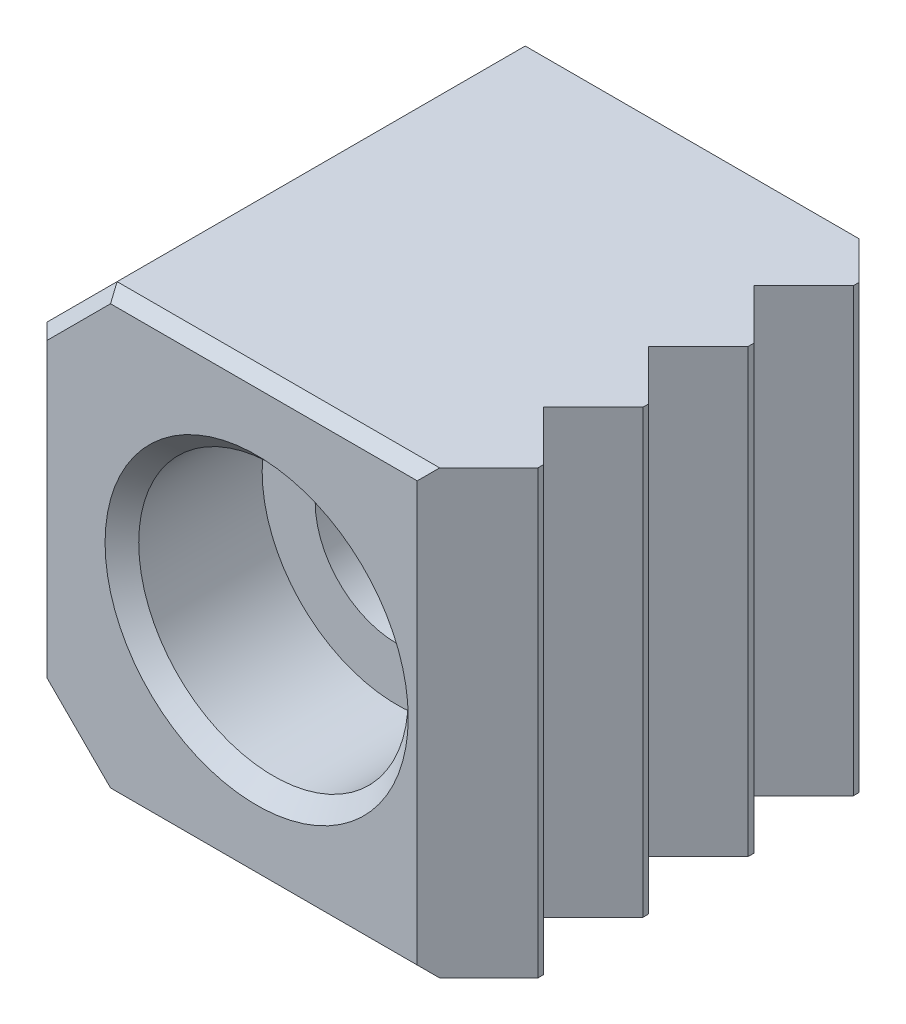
ISO-10303-21;
HEADER;
FILE_DESCRIPTION(('STEP AP214'),'2;1');
FILE_NAME('part.step','',(''),(''),'','','');
FILE_SCHEMA(('AUTOMOTIVE_DESIGN { 1 0 10303 214 1 1 1 1 }'));
ENDSEC;
DATA;
#1=APPLICATION_CONTEXT('core data for automotive mechanical design processes');
#2=APPLICATION_PROTOCOL_DEFINITION('international standard','automotive_design',2000,#1);
#3=PRODUCT_CONTEXT('',#1,'mechanical');
#4=PRODUCT('Part','Part','',(#3));
#5=PRODUCT_RELATED_PRODUCT_CATEGORY('part','',(#4));
#6=PRODUCT_DEFINITION_FORMATION('','',#4);
#7=PRODUCT_DEFINITION_CONTEXT('part definition',#1,'design');
#8=PRODUCT_DEFINITION('design','',#6,#7);
#9=PRODUCT_DEFINITION_SHAPE('','',#8);
#10=(LENGTH_UNIT() NAMED_UNIT(*) SI_UNIT(.MILLI.,.METRE.));
#11=(NAMED_UNIT(*) PLANE_ANGLE_UNIT() SI_UNIT($,.RADIAN.));
#12=(NAMED_UNIT(*) SI_UNIT($,.STERADIAN.) SOLID_ANGLE_UNIT());
#13=UNCERTAINTY_MEASURE_WITH_UNIT(LENGTH_MEASURE(1.E-05),#10,'distance_accuracy_value','');
#14=(GEOMETRIC_REPRESENTATION_CONTEXT(3) GLOBAL_UNCERTAINTY_ASSIGNED_CONTEXT((#13)) GLOBAL_UNIT_ASSIGNED_CONTEXT((#10,
#11,#12)) REPRESENTATION_CONTEXT('',''));
#15=CARTESIAN_POINT('',(0.,0.,0.));
#16=DIRECTION('',(0.,0.,1.));
#17=DIRECTION('',(1.,0.,0.));
#18=AXIS2_PLACEMENT_3D('',#15,#16,#17);
#19=CARTESIAN_POINT('',(5.,-5.,10.));
#20=DIRECTION('',(-1.,0.,0.));
#21=DIRECTION('',(0.,-1.,0.));
#22=AXIS2_PLACEMENT_3D('',#19,#20,#21);
#23=PLANE('',#22);
#24=DIRECTION('',(0.,-1.,0.));
#25=VECTOR('',#24,1.);
#26=CARTESIAN_POINT('',(5.,-5.,6.127125));
#27=LINE('',#26,#25);
#28=CARTESIAN_POINT('',(5.,5.,6.127125));
#29=VERTEX_POINT('',#28);
#30=CARTESIAN_POINT('',(5.,-5.,6.127125));
#31=VERTEX_POINT('',#30);
#32=EDGE_CURVE('E238',#29,#31,#27,.T.);
#33=ORIENTED_EDGE('',*,*,#32,.F.);
#34=DIRECTION('',(0.,0.,-1.));
#35=VECTOR('',#34,1.);
#36=CARTESIAN_POINT('',(5.,5.,10.));
#37=LINE('',#36,#35);
#38=CARTESIAN_POINT('',(5.,5.,6.25412500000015));
#39=VERTEX_POINT('',#38);
#40=EDGE_CURVE('E440',#39,#29,#37,.T.);
#41=ORIENTED_EDGE('',*,*,#40,.F.);
#42=DIRECTION('',(0.,1.,0.));
#43=VECTOR('',#42,1.);
#44=CARTESIAN_POINT('',(5.,-5.,6.25412500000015));
#45=LINE('',#44,#43);
#46=CARTESIAN_POINT('',(5.,-5.,6.25412500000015));
#47=VERTEX_POINT('',#46);
#48=EDGE_CURVE('E236',#47,#39,#45,.T.);
#49=ORIENTED_EDGE('',*,*,#48,.F.);
#50=DIRECTION('',(0.,0.,-1.));
#51=VECTOR('',#50,1.);
#52=CARTESIAN_POINT('',(5.,-5.,10.));
#53=LINE('',#52,#51);
#54=EDGE_CURVE('E197',#47,#31,#53,.T.);
#55=ORIENTED_EDGE('',*,*,#54,.T.);
#56=EDGE_LOOP('',(#33,#41,#49,#55));
#57=FACE_BOUND('',#56,.T.);
#58=ADVANCED_FACE('F15',(#57),#23,.F.);
#59=CARTESIAN_POINT('',(5.,-5.,3.87287499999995));
#60=VERTEX_POINT('',#59);
#61=CARTESIAN_POINT('',(5.,-5.,3.74587499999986));
#62=VERTEX_POINT('',#61);
#63=EDGE_CURVE('E255',#60,#62,#53,.T.);
#64=ORIENTED_EDGE('',*,*,#63,.T.);
#65=DIRECTION('',(0.,1.,0.));
#66=VECTOR('',#65,1.);
#67=CARTESIAN_POINT('',(5.,-5.,3.74587499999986));
#68=LINE('',#67,#66);
#69=CARTESIAN_POINT('',(5.,5.,3.74587499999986));
#70=VERTEX_POINT('',#69);
#71=EDGE_CURVE('E243',#62,#70,#68,.T.);
#72=ORIENTED_EDGE('',*,*,#71,.T.);
#73=CARTESIAN_POINT('',(5.,5.,3.87287499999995));
#74=VERTEX_POINT('',#73);
#75=EDGE_CURVE('E260',#74,#70,#37,.T.);
#76=ORIENTED_EDGE('',*,*,#75,.F.);
#77=DIRECTION('',(0.,-1.,0.));
#78=VECTOR('',#77,1.);
#79=CARTESIAN_POINT('',(5.,-5.,3.87287499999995));
#80=LINE('',#79,#78);
#81=EDGE_CURVE('E240',#74,#60,#80,.T.);
#82=ORIENTED_EDGE('',*,*,#81,.T.);
#83=EDGE_LOOP('',(#64,#72,#76,#82));
#84=FACE_BOUND('',#83,.T.);
#85=ADVANCED_FACE('F413',(#84),#23,.F.);
#86=DIRECTION('',(0.,-1.,0.));
#87=VECTOR('',#86,1.);
#88=CARTESIAN_POINT('',(5.,-5.,8.50837500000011));
#89=LINE('',#88,#87);
#90=CARTESIAN_POINT('',(5.,5.,8.50837500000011));
#91=VERTEX_POINT('',#90);
#92=CARTESIAN_POINT('',(5.,-5.,8.50837500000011));
#93=VERTEX_POINT('',#92);
#94=EDGE_CURVE('E186',#91,#93,#89,.T.);
#95=ORIENTED_EDGE('',*,*,#94,.F.);
#96=CARTESIAN_POINT('',(5.,5.,8.635375));
#97=VERTEX_POINT('',#96);
#98=EDGE_CURVE('E261',#97,#91,#37,.T.);
#99=ORIENTED_EDGE('',*,*,#98,.F.);
#100=DIRECTION('',(0.,1.,0.));
#101=VECTOR('',#100,1.);
#102=CARTESIAN_POINT('',(5.,-5.,8.6353750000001));
#103=LINE('',#102,#101);
#104=CARTESIAN_POINT('',(5.,-5.,8.6353750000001));
#105=VERTEX_POINT('',#104);
#106=EDGE_CURVE('E230',#105,#97,#103,.T.);
#107=ORIENTED_EDGE('',*,*,#106,.F.);
#108=EDGE_CURVE('E256',#105,#93,#53,.T.);
#109=ORIENTED_EDGE('',*,*,#108,.T.);
#110=EDGE_LOOP('',(#95,#99,#107,#109));
#111=FACE_BOUND('',#110,.T.);
#112=ADVANCED_FACE('F418',(#111),#23,.F.);
#113=CARTESIAN_POINT('',(-5.,5.,10.));
#114=DIRECTION('',(0.,1.,0.));
#115=DIRECTION('',(-1.,0.,0.));
#116=AXIS2_PLACEMENT_3D('',#113,#114,#115);
#117=PLANE('',#116);
#118=DIRECTION('',(0.,0.,1.));
#119=VECTOR('',#118,1.);
#120=CARTESIAN_POINT('',(-3.4125,5.,10.));
#121=LINE('',#120,#119);
#122=CARTESIAN_POINT('',(-3.4125,5.,0.508));
#123=VERTEX_POINT('',#122);
#124=CARTESIAN_POINT('',(-3.4125,5.,9.746));
#125=VERTEX_POINT('',#124);
#126=EDGE_CURVE('E274',#123,#125,#121,.T.);
#127=ORIENTED_EDGE('',*,*,#126,.T.);
#128=DIRECTION('',(1.,0.,0.));
#129=VECTOR('',#128,1.);
#130=CARTESIAN_POINT('',(3.635375,5.,9.746));
#131=LINE('',#130,#129);
#132=CARTESIAN_POINT('',(3.889375,5.,9.746));
#133=VERTEX_POINT('',#132);
#134=EDGE_CURVE('E9',#125,#133,#131,.T.);
#135=ORIENTED_EDGE('',*,*,#134,.T.);
#136=DIRECTION('',(-0.70710678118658,0.,0.707106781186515));
#137=VECTOR('',#136,1.);
#138=CARTESIAN_POINT('',(5.0635,5.,8.57187500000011));
#139=LINE('',#138,#137);
#140=EDGE_CURVE('E214',#97,#133,#139,.T.);
#141=ORIENTED_EDGE('',*,*,#140,.F.);
#142=ORIENTED_EDGE('',*,*,#98,.T.);
#143=DIRECTION('',(0.707106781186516,0.,0.707106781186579));
#144=VECTOR('',#143,1.);
#145=CARTESIAN_POINT('',(3.872875,5.,7.38125));
#146=LINE('',#145,#144);
#147=CARTESIAN_POINT('',(3.872875,5.,7.38125));
#148=VERTEX_POINT('',#147);
#149=EDGE_CURVE('E217',#148,#91,#146,.T.);
#150=ORIENTED_EDGE('',*,*,#149,.F.);
#151=DIRECTION('',(-0.707106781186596,0.,0.707106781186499));
#152=VECTOR('',#151,1.);
#153=CARTESIAN_POINT('',(5.0635,5.,6.19062500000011));
#154=LINE('',#153,#152);
#155=EDGE_CURVE('E176',#39,#148,#154,.T.);
#156=ORIENTED_EDGE('',*,*,#155,.F.);
#157=ORIENTED_EDGE('',*,*,#40,.T.);
#158=DIRECTION('',(0.707106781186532,0.,0.707106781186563));
#159=VECTOR('',#158,1.);
#160=CARTESIAN_POINT('',(3.872875,5.,5.));
#161=LINE('',#160,#159);
#162=CARTESIAN_POINT('',(3.872875,5.,5.));
#163=VERTEX_POINT('',#162);
#164=EDGE_CURVE('E220',#163,#29,#161,.T.);
#165=ORIENTED_EDGE('',*,*,#164,.F.);
#166=DIRECTION('',(0.707106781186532,0.,-0.707106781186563));
#167=VECTOR('',#166,1.);
#168=CARTESIAN_POINT('',(3.872875,5.,5.));
#169=LINE('',#168,#167);
#170=EDGE_CURVE('E222',#163,#74,#169,.T.);
#171=ORIENTED_EDGE('',*,*,#170,.T.);
#172=ORIENTED_EDGE('',*,*,#75,.T.);
#173=DIRECTION('',(-0.707106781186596,0.,-0.707106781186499));
#174=VECTOR('',#173,1.);
#175=CARTESIAN_POINT('',(5.0635,5.,3.80937499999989));
#176=LINE('',#175,#174);
#177=CARTESIAN_POINT('',(3.872875,5.,2.61875));
#178=VERTEX_POINT('',#177);
#179=EDGE_CURVE('E205',#70,#178,#176,.T.);
#180=ORIENTED_EDGE('',*,*,#179,.T.);
#181=DIRECTION('',(0.707106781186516,0.,-0.707106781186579));
#182=VECTOR('',#181,1.);
#183=CARTESIAN_POINT('',(3.872875,5.,2.61875));
#184=LINE('',#183,#182);
#185=CARTESIAN_POINT('',(5.,5.,1.49162499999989));
#186=VERTEX_POINT('',#185);
#187=EDGE_CURVE('E208',#178,#186,#184,.T.);
#188=ORIENTED_EDGE('',*,*,#187,.T.);
#189=CARTESIAN_POINT('',(5.,5.,1.3646249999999));
#190=VERTEX_POINT('',#189);
#191=EDGE_CURVE('E257',#186,#190,#37,.T.);
#192=ORIENTED_EDGE('',*,*,#191,.T.);
#193=DIRECTION('',(-0.707106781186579,0.,-0.707106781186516));
#194=VECTOR('',#193,1.);
#195=CARTESIAN_POINT('',(5.0635,5.,1.42812499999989));
#196=LINE('',#195,#194);
#197=CARTESIAN_POINT('',(4.143375,5.,0.508));
#198=VERTEX_POINT('',#197);
#199=EDGE_CURVE('E211',#190,#198,#196,.T.);
#200=ORIENTED_EDGE('',*,*,#199,.T.);
#201=DIRECTION('',(-1.,0.,0.));
#202=VECTOR('',#201,1.);
#203=CARTESIAN_POINT('',(-5.,5.,0.508));
#204=LINE('',#203,#202);
#205=EDGE_CURVE('E313',#198,#123,#204,.T.);
#206=ORIENTED_EDGE('',*,*,#205,.T.);
#207=EDGE_LOOP('',(#127,#135,#141,#142,#150,#156,#157,#165,#171,#172,#180,#188,#192,#200,#206));
#208=FACE_BOUND('',#207,.T.);
#209=ADVANCED_FACE('F432',(#208),#117,.T.);
#210=CARTESIAN_POINT('',(5.,-5.,10.));
#211=DIRECTION('',(0.,-1.,0.));
#212=DIRECTION('',(1.,0.,0.));
#213=AXIS2_PLACEMENT_3D('',#210,#211,#212);
#214=PLANE('',#213);
#215=DIRECTION('',(-0.70710678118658,0.,0.707106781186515));
#216=VECTOR('',#215,1.);
#217=CARTESIAN_POINT('',(5.0635,-5.,8.57187500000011));
#218=LINE('',#217,#216);
#219=CARTESIAN_POINT('',(3.889375,-5.,9.746));
#220=VERTEX_POINT('',#219);
#221=EDGE_CURVE('E190',#105,#220,#218,.T.);
#222=ORIENTED_EDGE('',*,*,#221,.T.);
#223=DIRECTION('',(-1.,0.,0.));
#224=VECTOR('',#223,1.);
#225=CARTESIAN_POINT('',(-3.4125,-5.,9.746));
#226=LINE('',#225,#224);
#227=CARTESIAN_POINT('',(-3.4125,-5.,9.746));
#228=VERTEX_POINT('',#227);
#229=EDGE_CURVE('E315',#220,#228,#226,.T.);
#230=ORIENTED_EDGE('',*,*,#229,.T.);
#231=DIRECTION('',(0.,0.,-1.));
#232=VECTOR('',#231,1.);
#233=CARTESIAN_POINT('',(-3.4125,-5.,0.));
#234=LINE('',#233,#232);
#235=CARTESIAN_POINT('',(-3.4125,-5.,0.508));
#236=VERTEX_POINT('',#235);
#237=EDGE_CURVE('E268',#228,#236,#234,.T.);
#238=ORIENTED_EDGE('',*,*,#237,.T.);
#239=DIRECTION('',(1.,0.,0.));
#240=VECTOR('',#239,1.);
#241=CARTESIAN_POINT('',(5.,-5.,0.508));
#242=LINE('',#241,#240);
#243=CARTESIAN_POINT('',(4.143375,-5.,0.508));
#244=VERTEX_POINT('',#243);
#245=EDGE_CURVE('E299',#236,#244,#242,.T.);
#246=ORIENTED_EDGE('',*,*,#245,.T.);
#247=DIRECTION('',(-0.707106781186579,0.,-0.707106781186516));
#248=VECTOR('',#247,1.);
#249=CARTESIAN_POINT('',(5.0635,-5.,1.42812499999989));
#250=LINE('',#249,#248);
#251=CARTESIAN_POINT('',(5.,-5.,1.3646249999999));
#252=VERTEX_POINT('',#251);
#253=EDGE_CURVE('E379',#252,#244,#250,.T.);
#254=ORIENTED_EDGE('',*,*,#253,.F.);
#255=CARTESIAN_POINT('',(5.,-5.,1.49162499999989));
#256=VERTEX_POINT('',#255);
#257=EDGE_CURVE('E252',#256,#252,#53,.T.);
#258=ORIENTED_EDGE('',*,*,#257,.F.);
#259=DIRECTION('',(0.707106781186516,0.,-0.707106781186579));
#260=VECTOR('',#259,1.);
#261=CARTESIAN_POINT('',(3.872875,-5.,2.61875));
#262=LINE('',#261,#260);
#263=CARTESIAN_POINT('',(3.872875,-5.,2.61875));
#264=VERTEX_POINT('',#263);
#265=EDGE_CURVE('E377',#264,#256,#262,.T.);
#266=ORIENTED_EDGE('',*,*,#265,.F.);
#267=DIRECTION('',(-0.707106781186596,0.,-0.707106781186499));
#268=VECTOR('',#267,1.);
#269=CARTESIAN_POINT('',(5.0635,-5.,3.80937499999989));
#270=LINE('',#269,#268);
#271=EDGE_CURVE('E374',#62,#264,#270,.T.);
#272=ORIENTED_EDGE('',*,*,#271,.F.);
#273=ORIENTED_EDGE('',*,*,#63,.F.);
#274=DIRECTION('',(0.707106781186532,0.,-0.707106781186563));
#275=VECTOR('',#274,1.);
#276=CARTESIAN_POINT('',(3.872875,-5.,5.));
#277=LINE('',#276,#275);
#278=CARTESIAN_POINT('',(3.872875,-5.,5.));
#279=VERTEX_POINT('',#278);
#280=EDGE_CURVE('E200',#279,#60,#277,.T.);
#281=ORIENTED_EDGE('',*,*,#280,.F.);
#282=DIRECTION('',(0.707106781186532,0.,0.707106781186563));
#283=VECTOR('',#282,1.);
#284=CARTESIAN_POINT('',(3.872875,-5.,5.));
#285=LINE('',#284,#283);
#286=EDGE_CURVE('E198',#279,#31,#285,.T.);
#287=ORIENTED_EDGE('',*,*,#286,.T.);
#288=ORIENTED_EDGE('',*,*,#54,.F.);
#289=DIRECTION('',(-0.707106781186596,0.,0.707106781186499));
#290=VECTOR('',#289,1.);
#291=CARTESIAN_POINT('',(5.0635,-5.,6.19062500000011));
#292=LINE('',#291,#290);
#293=CARTESIAN_POINT('',(3.872875,-5.,7.38125));
#294=VERTEX_POINT('',#293);
#295=EDGE_CURVE('E173',#47,#294,#292,.T.);
#296=ORIENTED_EDGE('',*,*,#295,.T.);
#297=DIRECTION('',(0.707106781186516,0.,0.707106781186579));
#298=VECTOR('',#297,1.);
#299=CARTESIAN_POINT('',(3.872875,-5.,7.38125));
#300=LINE('',#299,#298);
#301=EDGE_CURVE('E183',#294,#93,#300,.T.);
#302=ORIENTED_EDGE('',*,*,#301,.T.);
#303=ORIENTED_EDGE('',*,*,#108,.F.);
#304=EDGE_LOOP('',(#222,#230,#238,#246,#254,#258,#266,#272,#273,#281,#287,#288,#296,#302,#303));
#305=FACE_BOUND('',#304,.T.);
#306=ADVANCED_FACE('F194',(#305),#214,.T.);
#307=CARTESIAN_POINT('',(5.,5.,10.));
#308=DIRECTION('',(0.,0.,-1.));
#309=DIRECTION('',(1.,0.,0.));
#310=AXIS2_PLACEMENT_3D('',#307,#308,#309);
#311=PLANE('',#310);
#312=CARTESIAN_POINT('',(0.,0.,10.));
#313=DIRECTION('',(0.,0.,-1.));
#314=DIRECTION('',(1.,0.,0.));
#315=AXIS2_PLACEMENT_3D('',#312,#313,#314);
#316=CIRCLE('',#315,3.431);
#317=CARTESIAN_POINT('',(3.431,0.,10.));
#318=VERTEX_POINT('',#317);
#319=EDGE_CURVE('E279',#318,#318,#316,.T.);
#320=ORIENTED_EDGE('',*,*,#319,.T.);
#321=EDGE_LOOP('',(#320));
#322=FACE_BOUND('',#321,.T.);
#323=DIRECTION('',(0.707106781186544,-0.707106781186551,0.));
#324=VECTOR('',#323,1.);
#325=CARTESIAN_POINT('',(-3.2328948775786,-4.82039487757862,10.));
#326=LINE('',#325,#324);
#327=CARTESIAN_POINT('',(-4.746,-3.30728975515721,10.));
#328=VERTEX_POINT('',#327);
#329=CARTESIAN_POINT('',(-3.30728975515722,-4.746,10.));
#330=VERTEX_POINT('',#329);
#331=EDGE_CURVE('E324',#328,#330,#326,.T.);
#332=ORIENTED_EDGE('',*,*,#331,.T.);
#333=DIRECTION('',(1.,0.,0.));
#334=VECTOR('',#333,1.);
#335=CARTESIAN_POINT('',(3.635375,-4.746,10.));
#336=LINE('',#335,#334);
#337=CARTESIAN_POINT('',(3.635375,-4.746,10.));
#338=VERTEX_POINT('',#337);
#339=EDGE_CURVE('E326',#330,#338,#336,.T.);
#340=ORIENTED_EDGE('',*,*,#339,.T.);
#341=DIRECTION('',(0.,-1.,0.));
#342=VECTOR('',#341,1.);
#343=CARTESIAN_POINT('',(3.635375,5.,10.));
#344=LINE('',#343,#342);
#345=CARTESIAN_POINT('',(3.635375,4.746,10.));
#346=VERTEX_POINT('',#345);
#347=EDGE_CURVE('E265',#346,#338,#344,.T.);
#348=ORIENTED_EDGE('',*,*,#347,.F.);
#349=DIRECTION('',(-1.,0.,0.));
#350=VECTOR('',#349,1.);
#351=CARTESIAN_POINT('',(-3.4125,4.746,10.));
#352=LINE('',#351,#350);
#353=CARTESIAN_POINT('',(-3.30728975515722,4.746,10.));
#354=VERTEX_POINT('',#353);
#355=EDGE_CURVE('E318',#346,#354,#352,.T.);
#356=ORIENTED_EDGE('',*,*,#355,.T.);
#357=DIRECTION('',(-0.707106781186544,-0.707106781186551,0.));
#358=VECTOR('',#357,1.);
#359=CARTESIAN_POINT('',(-4.82039487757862,3.23289487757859,10.));
#360=LINE('',#359,#358);
#361=CARTESIAN_POINT('',(-4.746,3.30728975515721,10.));
#362=VERTEX_POINT('',#361);
#363=EDGE_CURVE('E320',#354,#362,#360,.T.);
#364=ORIENTED_EDGE('',*,*,#363,.T.);
#365=DIRECTION('',(0.,-1.,0.));
#366=VECTOR('',#365,1.);
#367=CARTESIAN_POINT('',(-4.746,5.,10.));
#368=LINE('',#367,#366);
#369=EDGE_CURVE('E322',#362,#328,#368,.T.);
#370=ORIENTED_EDGE('',*,*,#369,.T.);
#371=EDGE_LOOP('',(#332,#340,#348,#356,#364,#370));
#372=FACE_BOUND('',#371,.T.);
#373=ADVANCED_FACE('F390',(#322,#372),#311,.F.);
#374=ORIENTED_EDGE('',*,*,#257,.T.);
#375=DIRECTION('',(0.,1.,0.));
#376=VECTOR('',#375,1.);
#377=CARTESIAN_POINT('',(5.,-5.,1.3646249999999));
#378=LINE('',#377,#376);
#379=EDGE_CURVE('E225',#252,#190,#378,.T.);
#380=ORIENTED_EDGE('',*,*,#379,.T.);
#381=ORIENTED_EDGE('',*,*,#191,.F.);
#382=DIRECTION('',(0.,-1.,0.));
#383=VECTOR('',#382,1.);
#384=CARTESIAN_POINT('',(5.,-5.,1.49162499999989));
#385=LINE('',#384,#383);
#386=EDGE_CURVE('E232',#186,#256,#385,.T.);
#387=ORIENTED_EDGE('',*,*,#386,.T.);
#388=EDGE_LOOP('',(#374,#380,#381,#387));
#389=FACE_BOUND('',#388,.T.);
#390=ADVANCED_FACE('F17',(#389),#23,.F.);
#391=CARTESIAN_POINT('',(-5.,5.,10.));
#392=DIRECTION('',(1.,0.,0.));
#393=DIRECTION('',(0.,1.,0.));
#394=AXIS2_PLACEMENT_3D('',#391,#392,#393);
#395=PLANE('',#394);
#396=DIRECTION('',(0.,0.,1.));
#397=VECTOR('',#396,1.);
#398=CARTESIAN_POINT('',(-5.,-3.4125,10.));
#399=LINE('',#398,#397);
#400=CARTESIAN_POINT('',(-5.,-3.4125,0.508));
#401=VERTEX_POINT('',#400);
#402=CARTESIAN_POINT('',(-5.,-3.4125,9.746));
#403=VERTEX_POINT('',#402);
#404=EDGE_CURVE('E272',#401,#403,#399,.T.);
#405=ORIENTED_EDGE('',*,*,#404,.T.);
#406=DIRECTION('',(0.,1.,0.));
#407=VECTOR('',#406,1.);
#408=CARTESIAN_POINT('',(-5.,5.,9.746));
#409=LINE('',#408,#407);
#410=CARTESIAN_POINT('',(-5.,3.4125,9.746));
#411=VERTEX_POINT('',#410);
#412=EDGE_CURVE('E37',#403,#411,#409,.T.);
#413=ORIENTED_EDGE('',*,*,#412,.T.);
#414=DIRECTION('',(0.,0.,-1.));
#415=VECTOR('',#414,1.);
#416=CARTESIAN_POINT('',(-5.,3.4125,0.));
#417=LINE('',#416,#415);
#418=CARTESIAN_POINT('',(-5.,3.4125,0.508));
#419=VERTEX_POINT('',#418);
#420=EDGE_CURVE('E270',#411,#419,#417,.T.);
#421=ORIENTED_EDGE('',*,*,#420,.T.);
#422=DIRECTION('',(0.,-1.,0.));
#423=VECTOR('',#422,1.);
#424=CARTESIAN_POINT('',(-5.,-3.4125,0.508));
#425=LINE('',#424,#423);
#426=EDGE_CURVE('E308',#419,#401,#425,.T.);
#427=ORIENTED_EDGE('',*,*,#426,.T.);
#428=EDGE_LOOP('',(#405,#413,#421,#427));
#429=FACE_BOUND('',#428,.T.);
#430=ADVANCED_FACE('F343',(#429),#395,.F.);
#431=CARTESIAN_POINT('',(5.,5.,0.));
#432=DIRECTION('',(0.,0.,-1.));
#433=DIRECTION('',(1.,0.,0.));
#434=AXIS2_PLACEMENT_3D('',#431,#432,#433);
#435=PLANE('',#434);
#436=CARTESIAN_POINT('',(0.,0.,0.));
#437=DIRECTION('',(0.,0.,-1.));
#438=DIRECTION('',(1.,0.,0.));
#439=AXIS2_PLACEMENT_3D('',#436,#437,#438);
#440=CIRCLE('',#439,2.231);
#441=CARTESIAN_POINT('',(2.231,0.,0.));
#442=VERTEX_POINT('',#441);
#443=EDGE_CURVE('E282',#442,#442,#440,.F.);
#444=ORIENTED_EDGE('',*,*,#443,.T.);
#445=EDGE_LOOP('',(#444));
#446=FACE_BOUND('',#445,.T.);
#447=DIRECTION('',(0.,1.,0.));
#448=VECTOR('',#447,1.);
#449=CARTESIAN_POINT('',(3.635375,5.,0.));
#450=LINE('',#449,#448);
#451=CARTESIAN_POINT('',(3.635375,-4.492,0.));
#452=VERTEX_POINT('',#451);
#453=CARTESIAN_POINT('',(3.635375,4.492,0.));
#454=VERTEX_POINT('',#453);
#455=EDGE_CURVE('E262',#452,#454,#450,.T.);
#456=ORIENTED_EDGE('',*,*,#455,.F.);
#457=DIRECTION('',(-1.,0.,0.));
#458=VECTOR('',#457,1.);
#459=CARTESIAN_POINT('',(5.,-4.492,0.));
#460=LINE('',#459,#458);
#461=CARTESIAN_POINT('',(-3.20207951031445,-4.492,0.));
#462=VERTEX_POINT('',#461);
#463=EDGE_CURVE('E296',#452,#462,#460,.T.);
#464=ORIENTED_EDGE('',*,*,#463,.T.);
#465=DIRECTION('',(-0.707106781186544,0.707106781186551,0.));
#466=VECTOR('',#465,1.);
#467=CARTESIAN_POINT('',(-3.84703975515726,-3.84703975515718,0.));
#468=LINE('',#467,#466);
#469=CARTESIAN_POINT('',(-4.492,-3.20207951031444,0.));
#470=VERTEX_POINT('',#469);
#471=EDGE_CURVE('E294',#462,#470,#468,.T.);
#472=ORIENTED_EDGE('',*,*,#471,.T.);
#473=DIRECTION('',(0.,1.,0.));
#474=VECTOR('',#473,1.);
#475=CARTESIAN_POINT('',(-4.492,3.4125,0.));
#476=LINE('',#475,#474);
#477=CARTESIAN_POINT('',(-4.492,3.20207951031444,0.));
#478=VERTEX_POINT('',#477);
#479=EDGE_CURVE('E292',#470,#478,#476,.T.);
#480=ORIENTED_EDGE('',*,*,#479,.T.);
#481=DIRECTION('',(0.707106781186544,0.707106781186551,0.));
#482=VECTOR('',#481,1.);
#483=CARTESIAN_POINT('',(1.15296024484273,8.84703975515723,0.));
#484=LINE('',#483,#482);
#485=CARTESIAN_POINT('',(-3.20207951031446,4.492,0.));
#486=VERTEX_POINT('',#485);
#487=EDGE_CURVE('E290',#478,#486,#484,.T.);
#488=ORIENTED_EDGE('',*,*,#487,.T.);
#489=DIRECTION('',(1.,0.,0.));
#490=VECTOR('',#489,1.);
#491=CARTESIAN_POINT('',(5.,4.492,0.));
#492=LINE('',#491,#490);
#493=EDGE_CURVE('E288',#486,#454,#492,.T.);
#494=ORIENTED_EDGE('',*,*,#493,.T.);
#495=EDGE_LOOP('',(#456,#464,#472,#480,#488,#494));
#496=FACE_BOUND('',#495,.T.);
#497=ADVANCED_FACE('F427',(#446,#496),#435,.T.);
#498=CARTESIAN_POINT('',(0.,0.,6.825));
#499=DIRECTION('',(0.,0.,1.));
#500=DIRECTION('',(-1.,0.,0.));
#501=AXIS2_PLACEMENT_3D('',#498,#499,#500);
#502=CYLINDRICAL_SURFACE('',#501,3.05);
#503=CARTESIAN_POINT('',(0.,0.,9.619));
#504=DIRECTION('',(0.,0.,-1.));
#505=DIRECTION('',(1.,0.,0.));
#506=AXIS2_PLACEMENT_3D('',#503,#504,#505);
#507=CIRCLE('',#506,3.05);
#508=CARTESIAN_POINT('',(3.05,0.,9.619));
#509=VERTEX_POINT('',#508);
#510=EDGE_CURVE('E276',#509,#509,#507,.F.);
#511=ORIENTED_EDGE('',*,*,#510,.T.);
#512=EDGE_LOOP('',(#511));
#513=FACE_BOUND('',#512,.T.);
#514=CARTESIAN_POINT('',(0.,0.,6.825));
#515=DIRECTION('',(0.,0.,1.));
#516=DIRECTION('',(-1.,0.,0.));
#517=AXIS2_PLACEMENT_3D('',#514,#515,#516);
#518=CIRCLE('',#517,3.05);
#519=CARTESIAN_POINT('',(-3.05,0.,6.825));
#520=VERTEX_POINT('',#519);
#521=EDGE_CURVE('E249',#520,#520,#518,.T.);
#522=ORIENTED_EDGE('',*,*,#521,.F.);
#523=EDGE_LOOP('',(#522));
#524=FACE_BOUND('',#523,.T.);
#525=ADVANCED_FACE('F514',(#513,#524),#502,.F.);
#526=CARTESIAN_POINT('',(0.,0.,6.825));
#527=DIRECTION('',(0.,0.,1.));
#528=DIRECTION('',(-1.,0.,0.));
#529=AXIS2_PLACEMENT_3D('',#526,#527,#528);
#530=PLANE('',#529);
#531=CARTESIAN_POINT('',(0.,0.,6.825));
#532=DIRECTION('',(0.,0.,1.));
#533=DIRECTION('',(-1.,0.,0.));
#534=AXIS2_PLACEMENT_3D('',#531,#532,#533);
#535=CIRCLE('',#534,1.85);
#536=CARTESIAN_POINT('',(-1.85,0.,6.825));
#537=VERTEX_POINT('',#536);
#538=EDGE_CURVE('E246',#537,#537,#535,.T.);
#539=ORIENTED_EDGE('',*,*,#538,.F.);
#540=EDGE_LOOP('',(#539));
#541=FACE_BOUND('',#540,.T.);
#542=ORIENTED_EDGE('',*,*,#521,.T.);
#543=EDGE_LOOP('',(#542));
#544=FACE_BOUND('',#543,.T.);
#545=ADVANCED_FACE('F510',(#541,#544),#530,.T.);
#546=CARTESIAN_POINT('',(0.,0.,0.));
#547=DIRECTION('',(0.,0.,1.));
#548=DIRECTION('',(-1.,0.,0.));
#549=AXIS2_PLACEMENT_3D('',#546,#547,#548);
#550=CYLINDRICAL_SURFACE('',#549,1.85);
#551=CARTESIAN_POINT('',(0.,0.,0.381));
#552=DIRECTION('',(0.,0.,-1.));
#553=DIRECTION('',(1.,0.,0.));
#554=AXIS2_PLACEMENT_3D('',#551,#552,#553);
#555=CIRCLE('',#554,1.85);
#556=CARTESIAN_POINT('',(1.85,0.,0.381));
#557=VERTEX_POINT('',#556);
#558=EDGE_CURVE('E285',#557,#557,#555,.T.);
#559=ORIENTED_EDGE('',*,*,#558,.T.);
#560=EDGE_LOOP('',(#559));
#561=FACE_BOUND('',#560,.T.);
#562=ORIENTED_EDGE('',*,*,#538,.T.);
#563=EDGE_LOOP('',(#562));
#564=FACE_BOUND('',#563,.T.);
#565=ADVANCED_FACE('F503',(#561,#564),#550,.F.);
#566=CARTESIAN_POINT('',(5.0635,5.,1.42812499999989));
#567=DIRECTION('',(-0.707106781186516,0.,0.707106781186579));
#568=DIRECTION('',(-0.707106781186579,0.,-0.707106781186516));
#569=AXIS2_PLACEMENT_3D('',#566,#567,#568);
#570=PLANE('',#569);
#571=ORIENTED_EDGE('',*,*,#253,.T.);
#572=DIRECTION('',(0.577350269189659,-0.577350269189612,0.577350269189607));
#573=VECTOR('',#572,1.);
#574=CARTESIAN_POINT('',(4.09025,-4.946875,0.45487500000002));
#575=LINE('',#574,#573);
#576=EDGE_CURVE('E303',#244,#452,#575,.F.);
#577=ORIENTED_EDGE('',*,*,#576,.T.);
#578=ORIENTED_EDGE('',*,*,#455,.T.);
#579=DIRECTION('',(-0.577350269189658,-0.577350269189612,-0.577350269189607));
#580=VECTOR('',#579,1.);
#581=CARTESIAN_POINT('',(4.09025,4.946875,0.45487500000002));
#582=LINE('',#581,#580);
#583=EDGE_CURVE('E301',#454,#198,#582,.F.);
#584=ORIENTED_EDGE('',*,*,#583,.T.);
#585=ORIENTED_EDGE('',*,*,#199,.F.);
#586=ORIENTED_EDGE('',*,*,#379,.F.);
#587=EDGE_LOOP('',(#571,#577,#578,#584,#585,#586));
#588=FACE_BOUND('',#587,.T.);
#589=ADVANCED_FACE('F500',(#588),#570,.F.);
#590=CARTESIAN_POINT('',(5.0635,5.,8.57187500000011));
#591=DIRECTION('',(0.707106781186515,0.,0.70710678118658));
#592=DIRECTION('',(-0.70710678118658,0.,0.707106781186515));
#593=AXIS2_PLACEMENT_3D('',#590,#591,#592);
#594=PLANE('',#593);
#595=ORIENTED_EDGE('',*,*,#347,.T.);
#596=DIRECTION('',(0.577350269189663,-0.577350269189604,-0.57735026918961));
#597=VECTOR('',#596,1.);
#598=CARTESIAN_POINT('',(1.3387916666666,-2.44941666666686,12.2965833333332));
#599=LINE('',#598,#597);
#600=EDGE_CURVE('E330',#338,#220,#599,.T.);
#601=ORIENTED_EDGE('',*,*,#600,.T.);
#602=ORIENTED_EDGE('',*,*,#221,.F.);
#603=ORIENTED_EDGE('',*,*,#106,.T.);
#604=ORIENTED_EDGE('',*,*,#140,.T.);
#605=DIRECTION('',(-0.577350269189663,-0.577350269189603,0.577350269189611));
#606=VECTOR('',#605,1.);
#607=CARTESIAN_POINT('',(4.672125,5.78275,8.96325));
#608=LINE('',#607,#606);
#609=EDGE_CURVE('E328',#133,#346,#608,.T.);
#610=ORIENTED_EDGE('',*,*,#609,.T.);
#611=EDGE_LOOP('',(#595,#601,#602,#603,#604,#610));
#612=FACE_BOUND('',#611,.T.);
#613=ADVANCED_FACE('F392',(#612),#594,.T.);
#614=CARTESIAN_POINT('',(3.872875,5.,2.61875));
#615=DIRECTION('',(-0.707106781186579,0.,-0.707106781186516));
#616=DIRECTION('',(0.707106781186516,0.,-0.707106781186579));
#617=AXIS2_PLACEMENT_3D('',#614,#615,#616);
#618=PLANE('',#617);
#619=ORIENTED_EDGE('',*,*,#187,.F.);
#620=DIRECTION('',(0.,-1.,0.));
#621=VECTOR('',#620,1.);
#622=CARTESIAN_POINT('',(3.872875,5.,2.61875));
#623=LINE('',#622,#621);
#624=EDGE_CURVE('E180',#178,#264,#623,.T.);
#625=ORIENTED_EDGE('',*,*,#624,.T.);
#626=ORIENTED_EDGE('',*,*,#265,.T.);
#627=ORIENTED_EDGE('',*,*,#386,.F.);
#628=EDGE_LOOP('',(#619,#625,#626,#627));
#629=FACE_BOUND('',#628,.T.);
#630=ADVANCED_FACE('F458',(#629),#618,.F.);
#631=CARTESIAN_POINT('',(5.0635,5.,3.80937499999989));
#632=DIRECTION('',(-0.707106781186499,0.,0.707106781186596));
#633=DIRECTION('',(-0.707106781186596,0.,-0.707106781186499));
#634=AXIS2_PLACEMENT_3D('',#631,#632,#633);
#635=PLANE('',#634);
#636=ORIENTED_EDGE('',*,*,#271,.T.);
#637=ORIENTED_EDGE('',*,*,#624,.F.);
#638=ORIENTED_EDGE('',*,*,#179,.F.);
#639=ORIENTED_EDGE('',*,*,#71,.F.);
#640=EDGE_LOOP('',(#636,#637,#638,#639));
#641=FACE_BOUND('',#640,.T.);
#642=ADVANCED_FACE('F451',(#641),#635,.F.);
#643=CARTESIAN_POINT('',(3.872875,5.,7.38125));
#644=DIRECTION('',(0.707106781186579,0.,-0.707106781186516));
#645=DIRECTION('',(0.707106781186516,0.,0.707106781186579));
#646=AXIS2_PLACEMENT_3D('',#643,#644,#645);
#647=PLANE('',#646);
#648=ORIENTED_EDGE('',*,*,#94,.T.);
#649=ORIENTED_EDGE('',*,*,#301,.F.);
#650=DIRECTION('',(0.,-1.,0.));
#651=VECTOR('',#650,1.);
#652=CARTESIAN_POINT('',(3.872875,5.,7.38125));
#653=LINE('',#652,#651);
#654=EDGE_CURVE('E169',#148,#294,#653,.T.);
#655=ORIENTED_EDGE('',*,*,#654,.F.);
#656=ORIENTED_EDGE('',*,*,#149,.T.);
#657=EDGE_LOOP('',(#648,#649,#655,#656));
#658=FACE_BOUND('',#657,.T.);
#659=ADVANCED_FACE('F184',(#658),#647,.T.);
#660=CARTESIAN_POINT('',(5.0635,5.,6.19062500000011));
#661=DIRECTION('',(0.707106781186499,0.,0.707106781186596));
#662=DIRECTION('',(-0.707106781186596,0.,0.707106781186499));
#663=AXIS2_PLACEMENT_3D('',#660,#661,#662);
#664=PLANE('',#663);
#665=ORIENTED_EDGE('',*,*,#48,.T.);
#666=ORIENTED_EDGE('',*,*,#155,.T.);
#667=ORIENTED_EDGE('',*,*,#654,.T.);
#668=ORIENTED_EDGE('',*,*,#295,.F.);
#669=EDGE_LOOP('',(#665,#666,#667,#668));
#670=FACE_BOUND('',#669,.T.);
#671=ADVANCED_FACE('F171',(#670),#664,.T.);
#672=CARTESIAN_POINT('',(3.872875,5.,5.));
#673=DIRECTION('',(-0.707106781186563,0.,-0.707106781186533));
#674=DIRECTION('',(0.707106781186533,0.,-0.707106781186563));
#675=AXIS2_PLACEMENT_3D('',#672,#673,#674);
#676=PLANE('',#675);
#677=ORIENTED_EDGE('',*,*,#170,.F.);
#678=DIRECTION('',(0.,-1.,0.));
#679=VECTOR('',#678,1.);
#680=CARTESIAN_POINT('',(3.872875,5.,5.));
#681=LINE('',#680,#679);
#682=EDGE_CURVE('E179',#163,#279,#681,.T.);
#683=ORIENTED_EDGE('',*,*,#682,.T.);
#684=ORIENTED_EDGE('',*,*,#280,.T.);
#685=ORIENTED_EDGE('',*,*,#81,.F.);
#686=EDGE_LOOP('',(#677,#683,#684,#685));
#687=FACE_BOUND('',#686,.T.);
#688=ADVANCED_FACE('F487',(#687),#676,.F.);
#689=CARTESIAN_POINT('',(3.872875,5.,5.));
#690=DIRECTION('',(0.707106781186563,0.,-0.707106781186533));
#691=DIRECTION('',(0.707106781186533,0.,0.707106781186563));
#692=AXIS2_PLACEMENT_3D('',#689,#690,#691);
#693=PLANE('',#692);
#694=ORIENTED_EDGE('',*,*,#32,.T.);
#695=ORIENTED_EDGE('',*,*,#286,.F.);
#696=ORIENTED_EDGE('',*,*,#682,.F.);
#697=ORIENTED_EDGE('',*,*,#164,.T.);
#698=EDGE_LOOP('',(#694,#695,#696,#697));
#699=FACE_BOUND('',#698,.T.);
#700=ADVANCED_FACE('F483',(#699),#693,.T.);
#701=CARTESIAN_POINT('',(-3.4125,-5.,10.));
#702=DIRECTION('',(-0.707106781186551,-0.707106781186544,0.));
#703=DIRECTION('',(0.707106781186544,-0.707106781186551,0.));
#704=AXIS2_PLACEMENT_3D('',#701,#702,#703);
#705=PLANE('',#704);
#706=ORIENTED_EDGE('',*,*,#237,.F.);
#707=DIRECTION('',(-0.707106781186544,0.707106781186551,0.));
#708=VECTOR('',#707,1.);
#709=CARTESIAN_POINT('',(-5.,-3.4125,9.746));
#710=LINE('',#709,#708);
#711=EDGE_CURVE('E332',#228,#403,#710,.T.);
#712=ORIENTED_EDGE('',*,*,#711,.T.);
#713=ORIENTED_EDGE('',*,*,#404,.F.);
#714=DIRECTION('',(0.707106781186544,-0.707106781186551,0.));
#715=VECTOR('',#714,1.);
#716=CARTESIAN_POINT('',(-3.4125,-5.,0.508));
#717=LINE('',#716,#715);
#718=EDGE_CURVE('E305',#401,#236,#717,.T.);
#719=ORIENTED_EDGE('',*,*,#718,.T.);
#720=EDGE_LOOP('',(#706,#712,#713,#719));
#721=FACE_BOUND('',#720,.T.);
#722=ADVANCED_FACE('F338',(#721),#705,.T.);
#723=CARTESIAN_POINT('',(-5.,3.4125,10.));
#724=DIRECTION('',(-0.707106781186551,0.707106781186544,0.));
#725=DIRECTION('',(-0.707106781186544,-0.707106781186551,0.));
#726=AXIS2_PLACEMENT_3D('',#723,#724,#725);
#727=PLANE('',#726);
#728=ORIENTED_EDGE('',*,*,#420,.F.);
#729=DIRECTION('',(0.707106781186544,0.707106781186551,0.));
#730=VECTOR('',#729,1.);
#731=CARTESIAN_POINT('',(-3.4125,5.,9.746));
#732=LINE('',#731,#730);
#733=EDGE_CURVE('E23',#411,#125,#732,.T.);
#734=ORIENTED_EDGE('',*,*,#733,.T.);
#735=ORIENTED_EDGE('',*,*,#126,.F.);
#736=DIRECTION('',(-0.707106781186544,-0.707106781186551,0.));
#737=VECTOR('',#736,1.);
#738=CARTESIAN_POINT('',(-5.,3.4125,0.508));
#739=LINE('',#738,#737);
#740=EDGE_CURVE('E310',#123,#419,#739,.T.);
#741=ORIENTED_EDGE('',*,*,#740,.T.);
#742=EDGE_LOOP('',(#728,#734,#735,#741));
#743=FACE_BOUND('',#742,.T.);
#744=ADVANCED_FACE('F472',(#743),#727,.T.);
#745=CARTESIAN_POINT('',(0.,0.,9.619));
#746=DIRECTION('',(0.,0.,1.));
#747=DIRECTION('',(-1.,0.,0.));
#748=AXIS2_PLACEMENT_3D('',#745,#746,#747);
#749=CONICAL_SURFACE('',#748,3.05,0.785398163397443);
#750=ORIENTED_EDGE('',*,*,#319,.F.);
#751=EDGE_LOOP('',(#750));
#752=FACE_BOUND('',#751,.T.);
#753=ORIENTED_EDGE('',*,*,#510,.F.);
#754=EDGE_LOOP('',(#753));
#755=FACE_BOUND('',#754,.T.);
#756=ADVANCED_FACE('F474',(#752,#755),#749,.F.);
#757=CARTESIAN_POINT('',(0.,0.,0.));
#758=DIRECTION('',(0.,0.,-1.));
#759=DIRECTION('',(1.,0.,0.));
#760=AXIS2_PLACEMENT_3D('',#757,#758,#759);
#761=CONICAL_SURFACE('',#760,2.231,0.785398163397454);
#762=ORIENTED_EDGE('',*,*,#558,.F.);
#763=EDGE_LOOP('',(#762));
#764=FACE_BOUND('',#763,.T.);
#765=ORIENTED_EDGE('',*,*,#443,.F.);
#766=EDGE_LOOP('',(#765));
#767=FACE_BOUND('',#766,.T.);
#768=ADVANCED_FACE('F480',(#764,#767),#761,.F.);
#769=CARTESIAN_POINT('',(5.,4.492,0.));
#770=DIRECTION('',(0.,-0.707106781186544,0.707106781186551));
#771=DIRECTION('',(0.,-0.707106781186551,-0.707106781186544));
#772=AXIS2_PLACEMENT_3D('',#769,#770,#771);
#773=PLANE('',#772);
#774=ORIENTED_EDGE('',*,*,#583,.F.);
#775=ORIENTED_EDGE('',*,*,#493,.F.);
#776=DIRECTION('',(-0.281084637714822,0.67859834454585,0.678598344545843));
#777=VECTOR('',#776,1.);
#778=CARTESIAN_POINT('',(-2.55404490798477,2.92750607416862,-1.56449392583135));
#779=LINE('',#778,#777);
#780=EDGE_CURVE('E371',#123,#486,#779,.F.);
#781=ORIENTED_EDGE('',*,*,#780,.F.);
#782=ORIENTED_EDGE('',*,*,#205,.F.);
#783=EDGE_LOOP('',(#774,#775,#781,#782));
#784=FACE_BOUND('',#783,.T.);
#785=ADVANCED_FACE('F465',(#784),#773,.F.);
#786=CARTESIAN_POINT('',(1.15296024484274,8.84703975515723,0.));
#787=DIRECTION('',(0.5,-0.5,0.707106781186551));
#788=DIRECTION('',(-0.816496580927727,0.,0.577350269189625));
#789=AXIS2_PLACEMENT_3D('',#786,#787,#788);
#790=PLANE('',#789);
#791=ORIENTED_EDGE('',*,*,#780,.T.);
#792=ORIENTED_EDGE('',*,*,#487,.F.);
#793=DIRECTION('',(0.678598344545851,-0.281084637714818,-0.678598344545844));
#794=VECTOR('',#793,1.);
#795=CARTESIAN_POINT('',(-2.96925987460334,2.57133989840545,-1.52274012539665));
#796=LINE('',#795,#794);
#797=EDGE_CURVE('E368',#419,#478,#796,.T.);
#798=ORIENTED_EDGE('',*,*,#797,.F.);
#799=ORIENTED_EDGE('',*,*,#740,.F.);
#800=EDGE_LOOP('',(#791,#792,#798,#799));
#801=FACE_BOUND('',#800,.T.);
#802=ADVANCED_FACE('F471',(#801),#790,.F.);
#803=CARTESIAN_POINT('',(-5.,5.,0.508));
#804=DIRECTION('',(-0.707106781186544,0.,-0.707106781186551));
#805=DIRECTION('',(0.707106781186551,0.,-0.707106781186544));
#806=AXIS2_PLACEMENT_3D('',#803,#804,#805);
#807=PLANE('',#806);
#808=ORIENTED_EDGE('',*,*,#797,.T.);
#809=ORIENTED_EDGE('',*,*,#479,.F.);
#810=DIRECTION('',(0.678598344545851,0.281084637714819,-0.678598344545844));
#811=VECTOR('',#810,1.);
#812=CARTESIAN_POINT('',(-3.39536971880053,-2.74784037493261,-1.09663028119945));
#813=LINE('',#812,#811);
#814=EDGE_CURVE('E365',#401,#470,#813,.T.);
#815=ORIENTED_EDGE('',*,*,#814,.F.);
#816=ORIENTED_EDGE('',*,*,#426,.F.);
#817=EDGE_LOOP('',(#808,#809,#815,#816));
#818=FACE_BOUND('',#817,.T.);
#819=ADVANCED_FACE('F664',(#818),#807,.T.);
#820=CARTESIAN_POINT('',(-3.84703975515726,-3.84703975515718,0.));
#821=DIRECTION('',(0.5,0.5,0.707106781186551));
#822=DIRECTION('',(-0.816496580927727,0.,0.577350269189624));
#823=AXIS2_PLACEMENT_3D('',#820,#821,#822);
#824=PLANE('',#823);
#825=ORIENTED_EDGE('',*,*,#814,.T.);
#826=ORIENTED_EDGE('',*,*,#471,.F.);
#827=DIRECTION('',(-0.281084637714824,-0.678598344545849,0.678598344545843));
#828=VECTOR('',#827,1.);
#829=CARTESIAN_POINT('',(-3.13001487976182,-4.31802059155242,-0.173979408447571));
#830=LINE('',#829,#828);
#831=EDGE_CURVE('E363',#236,#462,#830,.F.);
#832=ORIENTED_EDGE('',*,*,#831,.F.);
#833=ORIENTED_EDGE('',*,*,#718,.F.);
#834=EDGE_LOOP('',(#825,#826,#832,#833));
#835=FACE_BOUND('',#834,.T.);
#836=ADVANCED_FACE('F673',(#835),#824,.F.);
#837=CARTESIAN_POINT('',(5.,-4.492,0.));
#838=DIRECTION('',(0.,0.707106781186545,0.707106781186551));
#839=DIRECTION('',(0.,-0.707106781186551,0.707106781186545));
#840=AXIS2_PLACEMENT_3D('',#837,#838,#839);
#841=PLANE('',#840);
#842=ORIENTED_EDGE('',*,*,#576,.F.);
#843=ORIENTED_EDGE('',*,*,#245,.F.);
#844=ORIENTED_EDGE('',*,*,#831,.T.);
#845=ORIENTED_EDGE('',*,*,#463,.F.);
#846=EDGE_LOOP('',(#842,#843,#844,#845));
#847=FACE_BOUND('',#846,.T.);
#848=ADVANCED_FACE('F410',(#847),#841,.F.);
#849=CARTESIAN_POINT('',(-5.,5.,9.746));
#850=DIRECTION('',(0.,0.707106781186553,0.707106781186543));
#851=DIRECTION('',(0.,-0.707106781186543,0.707106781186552));
#852=AXIS2_PLACEMENT_3D('',#849,#850,#851);
#853=PLANE('',#852);
#854=ORIENTED_EDGE('',*,*,#609,.F.);
#855=ORIENTED_EDGE('',*,*,#134,.F.);
#856=DIRECTION('',(0.281084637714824,-0.678598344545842,0.678598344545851));
#857=VECTOR('',#856,1.);
#858=CARTESIAN_POINT('',(-3.53792611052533,5.302805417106,9.443194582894));
#859=LINE('',#858,#857);
#860=EDGE_CURVE('E357',#354,#125,#859,.F.);
#861=ORIENTED_EDGE('',*,*,#860,.F.);
#862=ORIENTED_EDGE('',*,*,#355,.F.);
#863=EDGE_LOOP('',(#854,#855,#861,#862));
#864=FACE_BOUND('',#863,.T.);
#865=ADVANCED_FACE('F397',(#864),#853,.T.);
#866=CARTESIAN_POINT('',(0.973355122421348,9.02664487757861,10.));
#867=DIRECTION('',(-0.5,0.5,0.707106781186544));
#868=DIRECTION('',(-0.816496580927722,0.,-0.577350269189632));
#869=AXIS2_PLACEMENT_3D('',#866,#867,#868);
#870=PLANE('',#869);
#871=ORIENTED_EDGE('',*,*,#860,.T.);
#872=ORIENTED_EDGE('',*,*,#733,.F.);
#873=DIRECTION('',(-0.678598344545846,0.281084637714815,-0.678598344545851));
#874=VECTOR('',#873,1.);
#875=CARTESIAN_POINT('',(-3.2031916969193,2.66823763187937,11.5428083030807));
#876=LINE('',#875,#874);
#877=EDGE_CURVE('E353',#362,#411,#876,.T.);
#878=ORIENTED_EDGE('',*,*,#877,.F.);
#879=ORIENTED_EDGE('',*,*,#363,.F.);
#880=EDGE_LOOP('',(#871,#872,#878,#879));
#881=FACE_BOUND('',#880,.T.);
#882=ADVANCED_FACE('F401',(#881),#870,.T.);
#883=CARTESIAN_POINT('',(-4.746,5.,10.));
#884=DIRECTION('',(0.70710678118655,0.,-0.707106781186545));
#885=DIRECTION('',(0.707106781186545,0.,0.70710678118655));
#886=AXIS2_PLACEMENT_3D('',#883,#884,#885);
#887=PLANE('',#886);
#888=ORIENTED_EDGE('',*,*,#877,.T.);
#889=ORIENTED_EDGE('',*,*,#412,.F.);
#890=DIRECTION('',(-0.678598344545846,-0.281084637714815,-0.678598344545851));
#891=VECTOR('',#890,1.);
#892=CARTESIAN_POINT('',(-3.16143789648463,-2.65094264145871,11.5845621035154));
#893=LINE('',#892,#891);
#894=EDGE_CURVE('E350',#328,#403,#893,.T.);
#895=ORIENTED_EDGE('',*,*,#894,.F.);
#896=ORIENTED_EDGE('',*,*,#369,.F.);
#897=EDGE_LOOP('',(#888,#889,#895,#896));
#898=FACE_BOUND('',#897,.T.);
#899=ADVANCED_FACE('F348',(#898),#887,.F.);
#900=CARTESIAN_POINT('',(-4.02664487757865,-4.02664487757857,10.));
#901=DIRECTION('',(-0.5,-0.5,0.707106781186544));
#902=DIRECTION('',(-0.816496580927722,0.,-0.577350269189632));
#903=AXIS2_PLACEMENT_3D('',#900,#901,#902);
#904=PLANE('',#903);
#905=ORIENTED_EDGE('',*,*,#894,.T.);
#906=ORIENTED_EDGE('',*,*,#711,.F.);
#907=DIRECTION('',(0.281084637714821,0.678598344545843,0.67859834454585));
#908=VECTOR('',#907,1.);
#909=CARTESIAN_POINT('',(-3.22691261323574,-4.55195241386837,10.1940475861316));
#910=LINE('',#909,#908);
#911=EDGE_CURVE('E355',#330,#228,#910,.F.);
#912=ORIENTED_EDGE('',*,*,#911,.F.);
#913=ORIENTED_EDGE('',*,*,#331,.F.);
#914=EDGE_LOOP('',(#905,#906,#912,#913));
#915=FACE_BOUND('',#914,.T.);
#916=ADVANCED_FACE('F354',(#915),#904,.T.);
#917=CARTESIAN_POINT('',(5.,-5.,9.746));
#918=DIRECTION('',(0.,-0.707106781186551,0.707106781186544));
#919=DIRECTION('',(0.,-0.707106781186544,-0.707106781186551));
#920=AXIS2_PLACEMENT_3D('',#917,#918,#919);
#921=PLANE('',#920);
#922=ORIENTED_EDGE('',*,*,#600,.F.);
#923=ORIENTED_EDGE('',*,*,#339,.F.);
#924=ORIENTED_EDGE('',*,*,#911,.T.);
#925=ORIENTED_EDGE('',*,*,#229,.F.);
#926=EDGE_LOOP('',(#922,#923,#924,#925));
#927=FACE_BOUND('',#926,.T.);
#928=ADVANCED_FACE('F386',(#927),#921,.T.);
#929=CLOSED_SHELL('',(#58,#85,#112,#209,#306,#373,#390,#430,#497,#525,#545,#565,#589,#613,#630,
#642,#659,#671,#688,#700,#722,#744,#756,#768,#785,#802,#819,#836,#848,#865,#882,#899,#916,#928));
#930=MANIFOLD_SOLID_BREP('B1',#929);
#931=ADVANCED_BREP_SHAPE_REPRESENTATION('',(#18,#930),#14);
#932=SHAPE_DEFINITION_REPRESENTATION(#9,#931);
ENDSEC;
END-ISO-10303-21;
